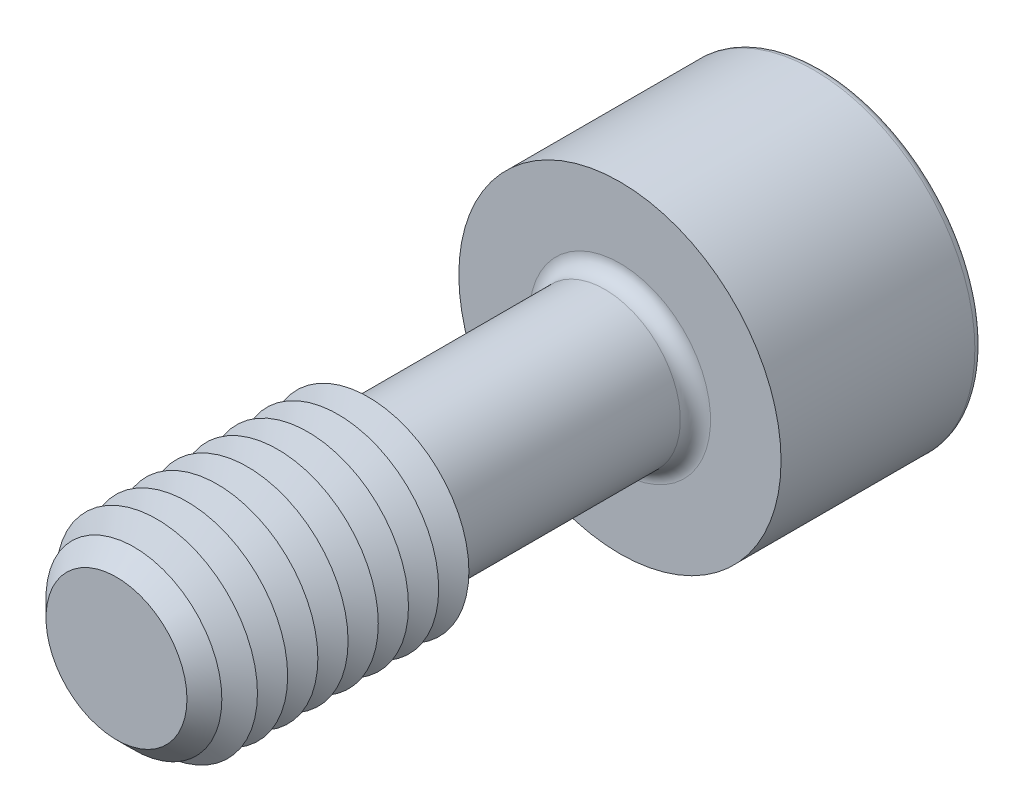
from build123d import *

# Parameters (mm, degrees)
SKETCH1_R       = 3.75
EXTRUDE1_DEPTH  = 12.5
CHAMFER1_SIZE   = 1.5
SKETCH3_R       = 8
EXTRUDE2_DEPTH  = 10
EXTRUDE3_DEPTH  = 8
FILLET1_R       = 0.75
FILLET2_R       = 0.375
LPATTERN1_COUNT = 8
LPATTERN1_PITCH = 1.5


with BuildPart() as part:
    # Sketch1 → Extrude1 (new, symmetric)
    with BuildSketch(Plane.XY):
        Circle(SKETCH1_R)
    extrude(amount=EXTRUDE1_DEPTH, both=True)

    # Sketch2 → Revolve1 (revolve)
    with BuildSketch(Plane(origin=(0, 0, 0), x_dir=(0, 0, -1), z_dir=(1, 0, 0))):
        Polygon((-12.5, 0), (-12.5, 5), (0, 5), (0.721687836, 3.75), (0.721687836, 0), align=None)
    revolve(axis=Axis((0, 0, -0.721687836), (0, 0, 1)))

    # Chamfer1
    chamfer1_edges = [part.edges().sort_by_distance(p)[0] for p in [
        (0, -5, 12.5),
    ]]
    chamfer(chamfer1_edges, length=CHAMFER1_SIZE)

    # Sketch3 → Extrude2 (add)
    with BuildSketch(Plane(origin=(0, 0, -12.5), x_dir=(-1, 0, 0), z_dir=(0, 0, -1))):
        Circle(SKETCH3_R)
    extrude(amount=EXTRUDE2_DEPTH)

    # Sketch4 → Extrude3 (cut)
    with BuildSketch(Plane(origin=(-13.7, 0, -22.5), x_dir=(1, 0, 0), z_dir=(0, 0, 1))):
        Polygon((11.390598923, -4), (16.009401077, -4), (18.318802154, 0), (16.009401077, 4), (11.390598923, 4), (9.081197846, 0), align=None)
    extrude(amount=EXTRUDE3_DEPTH, mode=Mode.SUBTRACT)

    # Fillet1
    fillet1_edges = [part.edges().sort_by_distance(p)[0] for p in [
        (-3.75, 0, -12.5),
    ]]
    fillet(fillet1_edges, radius=FILLET1_R)

    # Fillet2
    fillet2_edges = [part.edges().sort_by_distance(p)[0] for p in [
        (8, 0, -22.5),
    ]]
    fillet(fillet2_edges, radius=FILLET2_R)

    # Sketch5 → Cut-Revolve1 (revolve, cut)
    with BuildSketch(Plane(origin=(0, 0, 0), x_dir=(0, 0, -1), z_dir=(1, 0, 0)), mode=Mode.PRIVATE) as cut_revolve1_sk:
        Polygon((14.5, 0), (14.5, -4), (12.190598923, 0), align=None)
    revolve(cut_revolve1_sk.sketch.rotate(Axis((0, 0, -12.190598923), (0, 0, -1)), 90), axis=Axis((0, 0, -12.190598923), (0, 0, -1)), mode=Mode.SUBTRACT)

    # Sketch7 → Cut-Revolve2 (revolve, cut)
    with BuildSketch(Plane(origin=(0, 0, 0), x_dir=(0, 0, -1), z_dir=(1, 0, 0)), mode=Mode.PRIVATE) as cut_revolve2_sk:
        Polygon((0, 5), (-0.75, 3.700961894), (-1.5, 5), align=None)
    cut_revolve2 = revolve(cut_revolve2_sk.sketch.rotate(Axis((0, 0, -1.332048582), (0, 0, 1)), 90), axis=Axis((0, 0, -1.332048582), (0, 0, 1)), mode=Mode.SUBTRACT)

    # LPattern1: Cut-Revolve2 ×8
    with Locations(*[(0, 0, i * LPATTERN1_PITCH) for i in range(1, LPATTERN1_COUNT)]):
        add(cut_revolve2, mode=Mode.SUBTRACT)


solid = part.part
